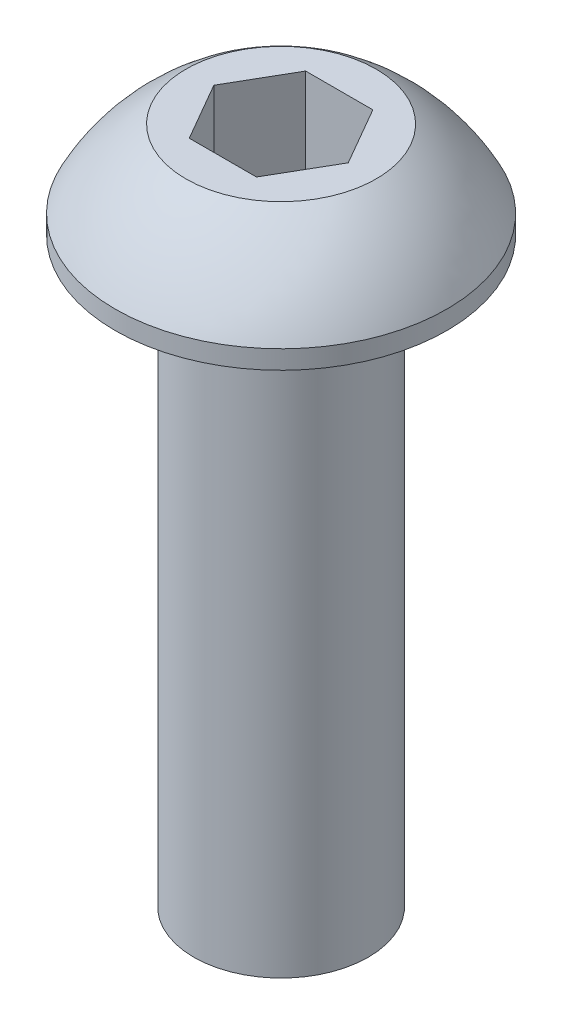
from build123d import *

# Parameters (mm, degrees)
CUT_EXTRUDE1_DEPTH = 1.524


with BuildPart() as part:
    # profiile → Base-Revolve (revolve)
    with BuildSketch(Plane.XY, mode=Mode.PRIVATE) as base_revolve_sk:
        with BuildLine():
            Line((0, 1.65), (1.634978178, 1.65))
            ThreePointArc((1.634978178, 1.65), (2.333092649, 1.06790397), (2.85, 0.320236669))
            Line((2.85, 0.320236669), (2.85, 0))
            Line((2.85, 0), (1.5, 0))
            Line((1.5, 0), (1.5, -10))
            Line((1.5, -10), (0, -10))
            Line((0, -10), (0, 1.65))
        make_face()
    revolve(base_revolve_sk.sketch.rotate(Axis((0, 9.907210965, 0), (0, -1, 0)), 90), axis=Axis((0, 9.907210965, 0), (0, -1, 0)))

    # Sketch1 → Cut-Extrude1 (cut)
    with BuildSketch(Plane(origin=(0, 1.65, 0), x_dir=(-1, 0, 0), z_dir=(0, 1, 0))):
        Polygon((1.154700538, 0), (0.577350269, 1), (-0.577350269, 1), (-1.154700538, 0), (-0.577350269, -1), (0.577350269, -1), align=None)
    extrude(amount=-CUT_EXTRUDE1_DEPTH, mode=Mode.SUBTRACT)


solid = part.part
